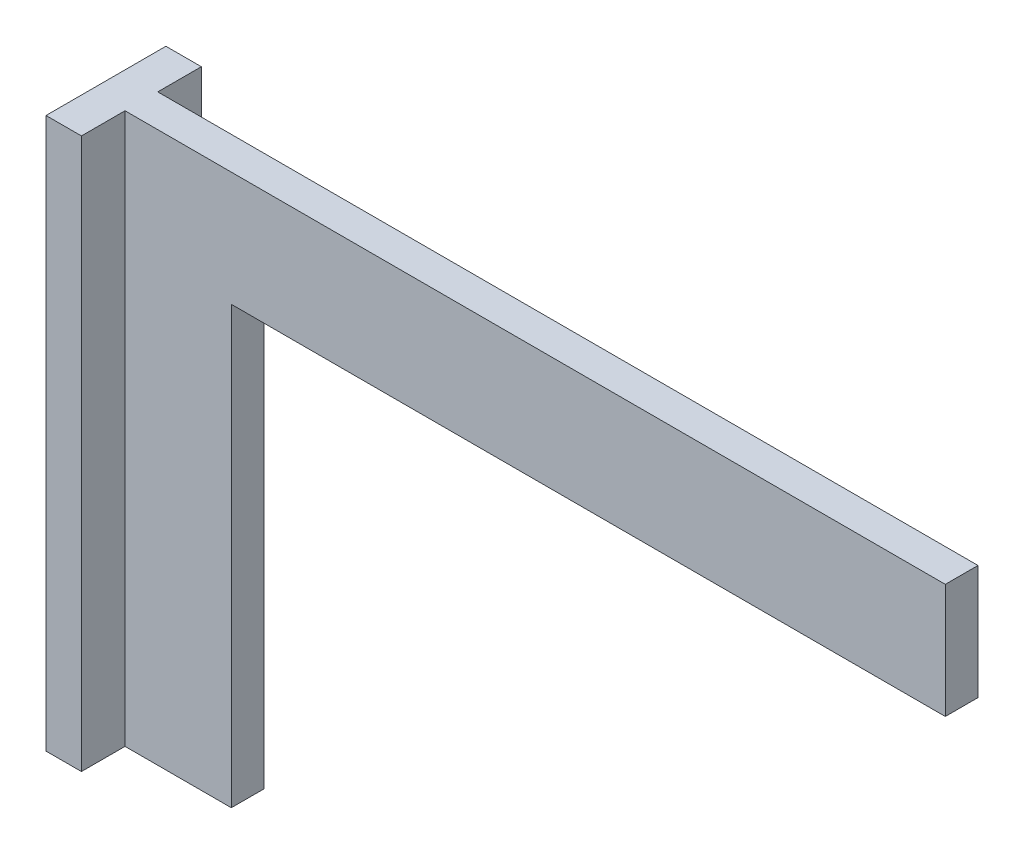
from build123d import *

# Parameters (mm, degrees)
BOSS_EXTRU_1_DEPTH      = 6
BOSS_EXTRU_2_DEPTH      = 8
BOSS_EXTRU_2_DEPTH_BACK = 14
ESQUISSE2_W             = 6.5
ESQUISSE2_H             = 101


with BuildPart() as part:
    # Esquisse1 → Boss.-Extru.1 (new body)
    with BuildSketch(Plane.XY):
        Polygon((0, 0), (0, 101), (157, 101), (157, 80), (26, 80), (26, 0), align=None)
    extrude(amount=BOSS_EXTRU_1_DEPTH)

    # Esquisse2 → Boss.-Extru.2 (add, two sides: drawn at the far end of the back side and taken through both)
    with BuildSketch(Plane.XY.offset(6).offset(-BOSS_EXTRU_2_DEPTH_BACK)):
        with Locations((3.25, 50.5)):
            Rectangle(ESQUISSE2_W, ESQUISSE2_H)
    extrude(amount=BOSS_EXTRU_2_DEPTH + BOSS_EXTRU_2_DEPTH_BACK)


solid = part.part
